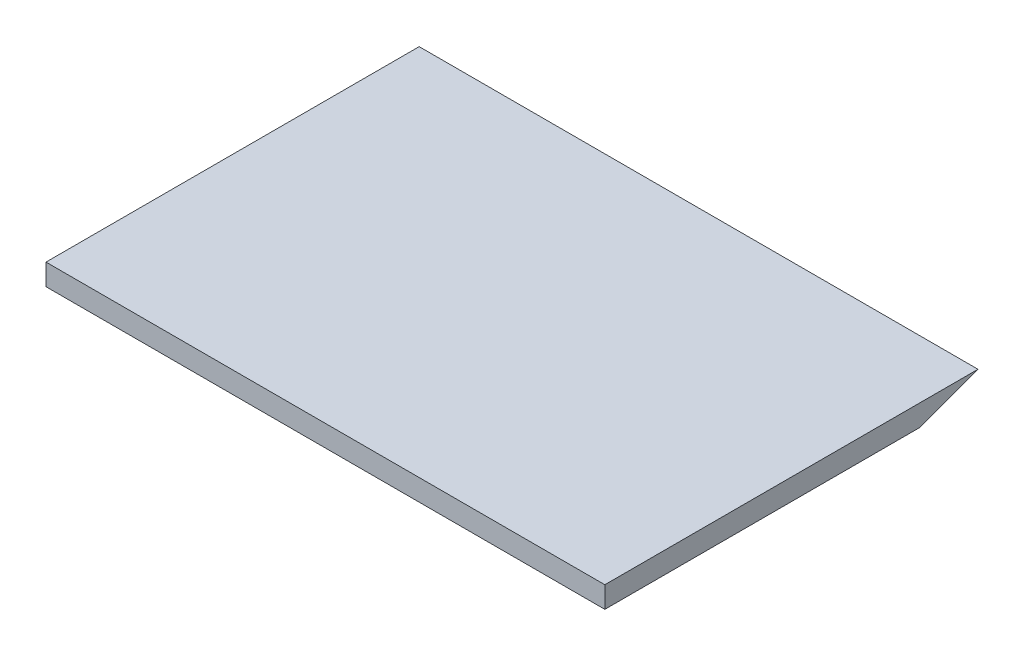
from build123d import *

# Parameters (mm, degrees)
SKETCH1_W           = 457.2
SKETCH1_H           = 17.4625
BOSS_EXTRUDE1_DEPTH = 305.308
CUT_EXTRUDE1_DEPTH  = 550.837293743


with BuildPart() as part:
    # Sketch1 → Boss-Extrude1 (new body)
    with BuildSketch(Plane.XY):
        Rectangle(SKETCH1_W, SKETCH1_H)
    extrude(amount=-BOSS_EXTRUDE1_DEPTH)

    # Sketch3 → Cut-Extrude1 (cut, through all)
    with BuildSketch(Plane(origin=(228.6, 0, 0), x_dir=(0, 0, -1), z_dir=(1, 0, 0))):
        Polygon((305.308, 8.73125), (257.782333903, -8.73125), (305.308, -8.73125), align=None)
    extrude(amount=-CUT_EXTRUDE1_DEPTH, mode=Mode.SUBTRACT)


solid = part.part
